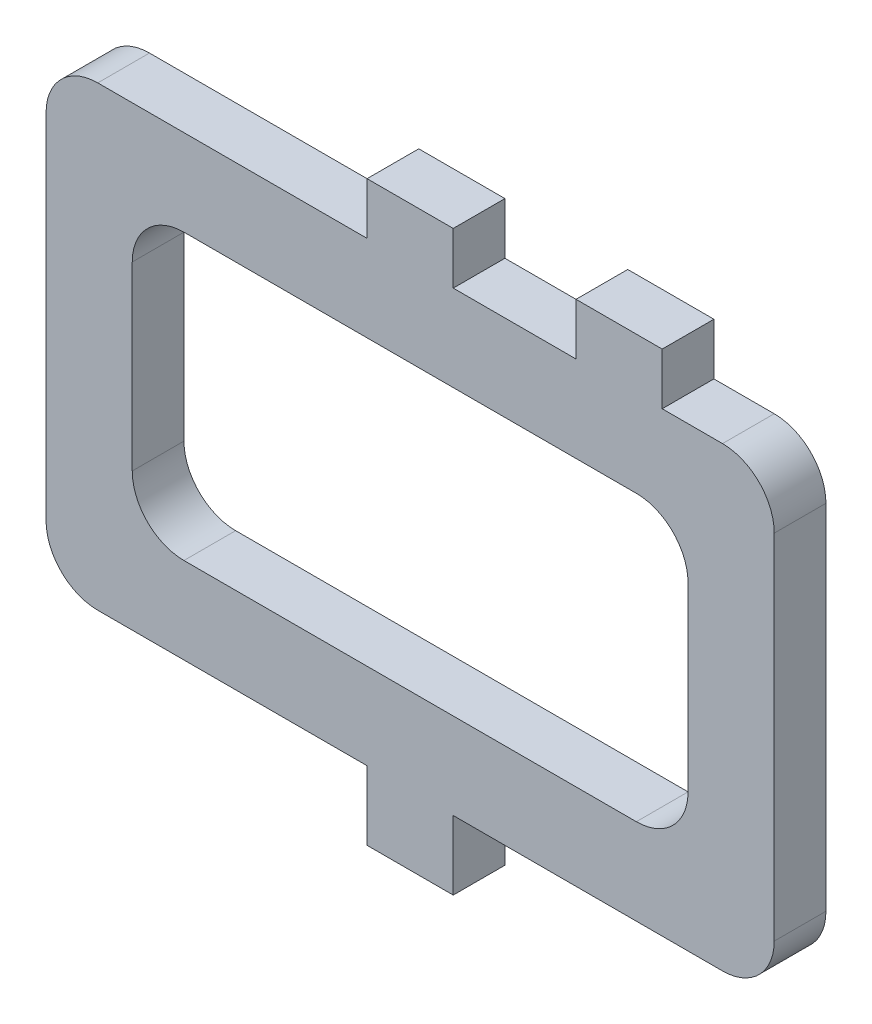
ISO-10303-21;
HEADER;
FILE_DESCRIPTION(('STEP AP214'),'2;1');
FILE_NAME('part.step','',(''),(''),'','','');
FILE_SCHEMA(('AUTOMOTIVE_DESIGN { 1 0 10303 214 1 1 1 1 }'));
ENDSEC;
DATA;
#1=APPLICATION_CONTEXT('core data for automotive mechanical design processes');
#2=APPLICATION_PROTOCOL_DEFINITION('international standard','automotive_design',2000,#1);
#3=PRODUCT_CONTEXT('',#1,'mechanical');
#4=PRODUCT('Part','Part','',(#3));
#5=PRODUCT_RELATED_PRODUCT_CATEGORY('part','',(#4));
#6=PRODUCT_DEFINITION_FORMATION('','',#4);
#7=PRODUCT_DEFINITION_CONTEXT('part definition',#1,'design');
#8=PRODUCT_DEFINITION('design','',#6,#7);
#9=PRODUCT_DEFINITION_SHAPE('','',#8);
#10=(LENGTH_UNIT() NAMED_UNIT(*) SI_UNIT(.MILLI.,.METRE.));
#11=(NAMED_UNIT(*) PLANE_ANGLE_UNIT() SI_UNIT($,.RADIAN.));
#12=(NAMED_UNIT(*) SI_UNIT($,.STERADIAN.) SOLID_ANGLE_UNIT());
#13=UNCERTAINTY_MEASURE_WITH_UNIT(LENGTH_MEASURE(1.E-05),#10,'distance_accuracy_value','');
#14=(GEOMETRIC_REPRESENTATION_CONTEXT(3) GLOBAL_UNCERTAINTY_ASSIGNED_CONTEXT((#13)) GLOBAL_UNIT_ASSIGNED_CONTEXT((#10,
#11,#12)) REPRESENTATION_CONTEXT('',''));
#15=CARTESIAN_POINT('',(0.,0.,0.));
#16=DIRECTION('',(0.,0.,1.));
#17=DIRECTION('',(1.,0.,0.));
#18=AXIS2_PLACEMENT_3D('',#15,#16,#17);
#19=CARTESIAN_POINT('',(-123.240102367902,-87.7219528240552,3.));
#20=DIRECTION('',(0.,0.,-1.));
#21=DIRECTION('',(-1.,0.,0.));
#22=AXIS2_PLACEMENT_3D('',#19,#20,#21);
#23=CYLINDRICAL_SURFACE('',#22,3.);
#24=CARTESIAN_POINT('',(-123.240102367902,-87.7219528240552,0.));
#25=DIRECTION('',(0.,0.,1.));
#26=DIRECTION('',(1.,0.,0.));
#27=AXIS2_PLACEMENT_3D('',#24,#25,#26);
#28=CIRCLE('',#27,3.);
#29=CARTESIAN_POINT('',(-126.240102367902,-87.7219528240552,0.));
#30=VERTEX_POINT('',#29);
#31=CARTESIAN_POINT('',(-123.240102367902,-90.7219528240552,0.));
#32=VERTEX_POINT('',#31);
#33=EDGE_CURVE('E258',#30,#32,#28,.T.);
#34=ORIENTED_EDGE('',*,*,#33,.T.);
#35=DIRECTION('',(0.,0.,-1.));
#36=VECTOR('',#35,1.);
#37=CARTESIAN_POINT('',(-123.240102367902,-90.7219528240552,3.));
#38=LINE('',#37,#36);
#39=CARTESIAN_POINT('',(-123.240102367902,-90.7219528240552,3.));
#40=VERTEX_POINT('',#39);
#41=EDGE_CURVE('E409',#40,#32,#38,.T.);
#42=ORIENTED_EDGE('',*,*,#41,.F.);
#43=CARTESIAN_POINT('',(-123.240102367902,-87.7219528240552,3.));
#44=DIRECTION('',(0.,0.,1.));
#45=DIRECTION('',(1.,0.,0.));
#46=AXIS2_PLACEMENT_3D('',#43,#44,#45);
#47=CIRCLE('',#46,3.);
#48=CARTESIAN_POINT('',(-126.240102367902,-87.7219528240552,3.));
#49=VERTEX_POINT('',#48);
#50=EDGE_CURVE('E269',#49,#40,#47,.T.);
#51=ORIENTED_EDGE('',*,*,#50,.F.);
#52=DIRECTION('',(0.,0.,-1.));
#53=VECTOR('',#52,1.);
#54=CARTESIAN_POINT('',(-126.240102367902,-87.7219528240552,3.));
#55=LINE('',#54,#53);
#56=EDGE_CURVE('E311',#49,#30,#55,.T.);
#57=ORIENTED_EDGE('',*,*,#56,.T.);
#58=EDGE_LOOP('',(#34,#42,#51,#57));
#59=FACE_BOUND('',#58,.T.);
#60=ADVANCED_FACE('F35',(#59),#23,.T.);
#61=CARTESIAN_POINT('',(-107.615102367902,-90.7219528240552,3.));
#62=DIRECTION('',(0.,1.,0.));
#63=DIRECTION('',(0.,0.,1.));
#64=AXIS2_PLACEMENT_3D('',#61,#62,#63);
#65=PLANE('',#64);
#66=DIRECTION('',(1.,0.,0.));
#67=VECTOR('',#66,1.);
#68=CARTESIAN_POINT('',(-107.615102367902,-90.7219528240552,0.));
#69=LINE('',#68,#67);
#70=CARTESIAN_POINT('',(-107.615102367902,-90.7219528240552,0.));
#71=VERTEX_POINT('',#70);
#72=EDGE_CURVE('E314',#32,#71,#69,.T.);
#73=ORIENTED_EDGE('',*,*,#72,.T.);
#74=DIRECTION('',(0.,0.,-1.));
#75=VECTOR('',#74,1.);
#76=CARTESIAN_POINT('',(-107.615102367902,-90.7219528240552,3.));
#77=LINE('',#76,#75);
#78=CARTESIAN_POINT('',(-107.615102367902,-90.7219528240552,3.));
#79=VERTEX_POINT('',#78);
#80=EDGE_CURVE('E406',#79,#71,#77,.T.);
#81=ORIENTED_EDGE('',*,*,#80,.F.);
#82=DIRECTION('',(1.,0.,0.));
#83=VECTOR('',#82,1.);
#84=CARTESIAN_POINT('',(-107.615102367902,-90.7219528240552,3.));
#85=LINE('',#84,#83);
#86=EDGE_CURVE('E272',#40,#79,#85,.T.);
#87=ORIENTED_EDGE('',*,*,#86,.F.);
#88=ORIENTED_EDGE('',*,*,#41,.T.);
#89=EDGE_LOOP('',(#73,#81,#87,#88));
#90=FACE_BOUND('',#89,.T.);
#91=ADVANCED_FACE('F460',(#90),#65,.F.);
#92=CARTESIAN_POINT('',(-107.615102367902,-94.7219528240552,3.));
#93=DIRECTION('',(1.,0.,0.));
#94=DIRECTION('',(0.,0.,-1.));
#95=AXIS2_PLACEMENT_3D('',#92,#93,#94);
#96=PLANE('',#95);
#97=DIRECTION('',(0.,-1.,0.));
#98=VECTOR('',#97,1.);
#99=CARTESIAN_POINT('',(-107.615102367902,-94.7219528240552,0.));
#100=LINE('',#99,#98);
#101=CARTESIAN_POINT('',(-107.615102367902,-94.7219528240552,0.));
#102=VERTEX_POINT('',#101);
#103=EDGE_CURVE('E316',#71,#102,#100,.T.);
#104=ORIENTED_EDGE('',*,*,#103,.T.);
#105=DIRECTION('',(0.,0.,-1.));
#106=VECTOR('',#105,1.);
#107=CARTESIAN_POINT('',(-107.615102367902,-94.7219528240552,3.));
#108=LINE('',#107,#106);
#109=CARTESIAN_POINT('',(-107.615102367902,-94.7219528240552,3.));
#110=VERTEX_POINT('',#109);
#111=EDGE_CURVE('E403',#110,#102,#108,.T.);
#112=ORIENTED_EDGE('',*,*,#111,.F.);
#113=DIRECTION('',(0.,-1.,0.));
#114=VECTOR('',#113,1.);
#115=CARTESIAN_POINT('',(-107.615102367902,-94.7219528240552,3.));
#116=LINE('',#115,#114);
#117=EDGE_CURVE('E275',#79,#110,#116,.T.);
#118=ORIENTED_EDGE('',*,*,#117,.F.);
#119=ORIENTED_EDGE('',*,*,#80,.T.);
#120=EDGE_LOOP('',(#104,#112,#118,#119));
#121=FACE_BOUND('',#120,.T.);
#122=ADVANCED_FACE('F465',(#121),#96,.F.);
#123=CARTESIAN_POINT('',(-105.115102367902,-94.7219528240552,3.));
#124=DIRECTION('',(0.,1.,0.));
#125=DIRECTION('',(0.,0.,1.));
#126=AXIS2_PLACEMENT_3D('',#123,#124,#125);
#127=PLANE('',#126);
#128=DIRECTION('',(1.,0.,0.));
#129=VECTOR('',#128,1.);
#130=CARTESIAN_POINT('',(-105.115102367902,-94.7219528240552,0.));
#131=LINE('',#130,#129);
#132=CARTESIAN_POINT('',(-102.615102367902,-94.7219528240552,0.));
#133=VERTEX_POINT('',#132);
#134=EDGE_CURVE('E319',#102,#133,#131,.T.);
#135=ORIENTED_EDGE('',*,*,#134,.T.);
#136=DIRECTION('',(0.,0.,-1.));
#137=VECTOR('',#136,1.);
#138=CARTESIAN_POINT('',(-102.615102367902,-94.7219528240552,3.));
#139=LINE('',#138,#137);
#140=CARTESIAN_POINT('',(-102.615102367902,-94.7219528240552,3.));
#141=VERTEX_POINT('',#140);
#142=EDGE_CURVE('E400',#141,#133,#139,.T.);
#143=ORIENTED_EDGE('',*,*,#142,.F.);
#144=DIRECTION('',(1.,0.,0.));
#145=VECTOR('',#144,1.);
#146=CARTESIAN_POINT('',(-107.615102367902,-94.7219528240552,3.));
#147=LINE('',#146,#145);
#148=EDGE_CURVE('E277',#110,#141,#147,.T.);
#149=ORIENTED_EDGE('',*,*,#148,.F.);
#150=ORIENTED_EDGE('',*,*,#111,.T.);
#151=EDGE_LOOP('',(#135,#143,#149,#150));
#152=FACE_BOUND('',#151,.T.);
#153=ADVANCED_FACE('F557',(#152),#127,.F.);
#154=CARTESIAN_POINT('',(-102.615102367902,-94.7219528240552,3.));
#155=DIRECTION('',(-1.,0.,0.));
#156=DIRECTION('',(0.,0.,1.));
#157=AXIS2_PLACEMENT_3D('',#154,#155,#156);
#158=PLANE('',#157);
#159=DIRECTION('',(0.,1.,0.));
#160=VECTOR('',#159,1.);
#161=CARTESIAN_POINT('',(-102.615102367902,-94.7219528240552,0.));
#162=LINE('',#161,#160);
#163=CARTESIAN_POINT('',(-102.615102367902,-90.7219528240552,0.));
#164=VERTEX_POINT('',#163);
#165=EDGE_CURVE('E321',#133,#164,#162,.T.);
#166=ORIENTED_EDGE('',*,*,#165,.T.);
#167=DIRECTION('',(0.,0.,-1.));
#168=VECTOR('',#167,1.);
#169=CARTESIAN_POINT('',(-102.615102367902,-90.7219528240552,3.));
#170=LINE('',#169,#168);
#171=CARTESIAN_POINT('',(-102.615102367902,-90.7219528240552,3.));
#172=VERTEX_POINT('',#171);
#173=EDGE_CURVE('E397',#172,#164,#170,.T.);
#174=ORIENTED_EDGE('',*,*,#173,.F.);
#175=DIRECTION('',(0.,1.,0.));
#176=VECTOR('',#175,1.);
#177=CARTESIAN_POINT('',(-102.615102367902,-94.7219528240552,3.));
#178=LINE('',#177,#176);
#179=EDGE_CURVE('E279',#141,#172,#178,.T.);
#180=ORIENTED_EDGE('',*,*,#179,.F.);
#181=ORIENTED_EDGE('',*,*,#142,.T.);
#182=EDGE_LOOP('',(#166,#174,#180,#181));
#183=FACE_BOUND('',#182,.T.);
#184=ADVANCED_FACE('F551',(#183),#158,.F.);
#185=CARTESIAN_POINT('',(-102.615102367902,-90.7219528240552,3.));
#186=DIRECTION('',(0.,1.,0.));
#187=DIRECTION('',(0.,0.,1.));
#188=AXIS2_PLACEMENT_3D('',#185,#186,#187);
#189=PLANE('',#188);
#190=DIRECTION('',(1.,0.,0.));
#191=VECTOR('',#190,1.);
#192=CARTESIAN_POINT('',(-102.615102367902,-90.7219528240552,0.));
#193=LINE('',#192,#191);
#194=CARTESIAN_POINT('',(-86.9901023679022,-90.7219528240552,0.));
#195=VERTEX_POINT('',#194);
#196=EDGE_CURVE('E323',#164,#195,#193,.T.);
#197=ORIENTED_EDGE('',*,*,#196,.T.);
#198=DIRECTION('',(0.,0.,-1.));
#199=VECTOR('',#198,1.);
#200=CARTESIAN_POINT('',(-86.9901023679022,-90.7219528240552,3.));
#201=LINE('',#200,#199);
#202=CARTESIAN_POINT('',(-86.9901023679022,-90.7219528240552,3.));
#203=VERTEX_POINT('',#202);
#204=EDGE_CURVE('E394',#203,#195,#201,.T.);
#205=ORIENTED_EDGE('',*,*,#204,.F.);
#206=DIRECTION('',(1.,0.,0.));
#207=VECTOR('',#206,1.);
#208=CARTESIAN_POINT('',(-102.615102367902,-90.7219528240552,3.));
#209=LINE('',#208,#207);
#210=EDGE_CURVE('E281',#172,#203,#209,.T.);
#211=ORIENTED_EDGE('',*,*,#210,.F.);
#212=ORIENTED_EDGE('',*,*,#173,.T.);
#213=EDGE_LOOP('',(#197,#205,#211,#212));
#214=FACE_BOUND('',#213,.T.);
#215=ADVANCED_FACE('F547',(#214),#189,.F.);
#216=CARTESIAN_POINT('',(-86.9901023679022,-87.7219528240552,3.));
#217=DIRECTION('',(0.,0.,-1.));
#218=DIRECTION('',(-1.,0.,0.));
#219=AXIS2_PLACEMENT_3D('',#216,#217,#218);
#220=CYLINDRICAL_SURFACE('',#219,3.);
#221=CARTESIAN_POINT('',(-86.9901023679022,-87.7219528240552,0.));
#222=DIRECTION('',(0.,0.,1.));
#223=DIRECTION('',(1.,0.,0.));
#224=AXIS2_PLACEMENT_3D('',#221,#222,#223);
#225=CIRCLE('',#224,3.);
#226=CARTESIAN_POINT('',(-83.9901023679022,-87.7219528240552,0.));
#227=VERTEX_POINT('',#226);
#228=EDGE_CURVE('E325',#195,#227,#225,.T.);
#229=ORIENTED_EDGE('',*,*,#228,.T.);
#230=DIRECTION('',(0.,0.,-1.));
#231=VECTOR('',#230,1.);
#232=CARTESIAN_POINT('',(-83.9901023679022,-87.7219528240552,3.));
#233=LINE('',#232,#231);
#234=CARTESIAN_POINT('',(-83.9901023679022,-87.7219528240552,3.));
#235=VERTEX_POINT('',#234);
#236=EDGE_CURVE('E391',#235,#227,#233,.T.);
#237=ORIENTED_EDGE('',*,*,#236,.F.);
#238=CARTESIAN_POINT('',(-86.9901023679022,-87.7219528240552,3.));
#239=DIRECTION('',(0.,0.,1.));
#240=DIRECTION('',(1.,0.,0.));
#241=AXIS2_PLACEMENT_3D('',#238,#239,#240);
#242=CIRCLE('',#241,3.);
#243=EDGE_CURVE('E283',#203,#235,#242,.T.);
#244=ORIENTED_EDGE('',*,*,#243,.F.);
#245=ORIENTED_EDGE('',*,*,#204,.T.);
#246=EDGE_LOOP('',(#229,#237,#244,#245));
#247=FACE_BOUND('',#246,.T.);
#248=ADVANCED_FACE('F542',(#247),#220,.T.);
#249=CARTESIAN_POINT('',(-83.9901023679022,-87.7219528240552,3.));
#250=DIRECTION('',(-1.,0.,0.));
#251=DIRECTION('',(0.,-1.,0.));
#252=AXIS2_PLACEMENT_3D('',#249,#250,#251);
#253=PLANE('',#252);
#254=DIRECTION('',(0.,1.,0.));
#255=VECTOR('',#254,1.);
#256=CARTESIAN_POINT('',(-83.9901023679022,-87.7219528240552,0.));
#257=LINE('',#256,#255);
#258=CARTESIAN_POINT('',(-83.9901023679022,-67.2219528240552,0.));
#259=VERTEX_POINT('',#258);
#260=EDGE_CURVE('E327',#227,#259,#257,.T.);
#261=ORIENTED_EDGE('',*,*,#260,.T.);
#262=DIRECTION('',(0.,0.,-1.));
#263=VECTOR('',#262,1.);
#264=CARTESIAN_POINT('',(-83.9901023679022,-67.2219528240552,3.));
#265=LINE('',#264,#263);
#266=CARTESIAN_POINT('',(-83.9901023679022,-67.2219528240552,3.));
#267=VERTEX_POINT('',#266);
#268=EDGE_CURVE('E388',#267,#259,#265,.T.);
#269=ORIENTED_EDGE('',*,*,#268,.F.);
#270=DIRECTION('',(0.,1.,0.));
#271=VECTOR('',#270,1.);
#272=CARTESIAN_POINT('',(-83.9901023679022,-87.7219528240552,3.));
#273=LINE('',#272,#271);
#274=EDGE_CURVE('E285',#235,#267,#273,.T.);
#275=ORIENTED_EDGE('',*,*,#274,.F.);
#276=ORIENTED_EDGE('',*,*,#236,.T.);
#277=EDGE_LOOP('',(#261,#269,#275,#276));
#278=FACE_BOUND('',#277,.T.);
#279=ADVANCED_FACE('F536',(#278),#253,.F.);
#280=CARTESIAN_POINT('',(-86.9901023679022,-67.2219528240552,3.));
#281=DIRECTION('',(0.,0.,-1.));
#282=DIRECTION('',(-1.,0.,0.));
#283=AXIS2_PLACEMENT_3D('',#280,#281,#282);
#284=CYLINDRICAL_SURFACE('',#283,3.);
#285=CARTESIAN_POINT('',(-86.9901023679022,-67.2219528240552,0.));
#286=DIRECTION('',(0.,0.,1.));
#287=DIRECTION('',(1.,0.,0.));
#288=AXIS2_PLACEMENT_3D('',#285,#286,#287);
#289=CIRCLE('',#288,3.);
#290=CARTESIAN_POINT('',(-86.9901023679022,-64.2219528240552,0.));
#291=VERTEX_POINT('',#290);
#292=EDGE_CURVE('E329',#259,#291,#289,.T.);
#293=ORIENTED_EDGE('',*,*,#292,.T.);
#294=DIRECTION('',(0.,0.,-1.));
#295=VECTOR('',#294,1.);
#296=CARTESIAN_POINT('',(-86.9901023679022,-64.2219528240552,3.));
#297=LINE('',#296,#295);
#298=CARTESIAN_POINT('',(-86.9901023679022,-64.2219528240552,3.));
#299=VERTEX_POINT('',#298);
#300=EDGE_CURVE('E385',#299,#291,#297,.T.);
#301=ORIENTED_EDGE('',*,*,#300,.F.);
#302=CARTESIAN_POINT('',(-86.9901023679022,-67.2219528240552,3.));
#303=DIRECTION('',(0.,0.,1.));
#304=DIRECTION('',(1.,0.,0.));
#305=AXIS2_PLACEMENT_3D('',#302,#303,#304);
#306=CIRCLE('',#305,3.);
#307=EDGE_CURVE('E287',#267,#299,#306,.T.);
#308=ORIENTED_EDGE('',*,*,#307,.F.);
#309=ORIENTED_EDGE('',*,*,#268,.T.);
#310=EDGE_LOOP('',(#293,#301,#308,#309));
#311=FACE_BOUND('',#310,.T.);
#312=ADVANCED_FACE('F532',(#311),#284,.T.);
#313=CARTESIAN_POINT('',(-90.4901023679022,-64.2219528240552,3.));
#314=DIRECTION('',(0.,-1.,0.));
#315=DIRECTION('',(0.,0.,-1.));
#316=AXIS2_PLACEMENT_3D('',#313,#314,#315);
#317=PLANE('',#316);
#318=DIRECTION('',(-1.,0.,0.));
#319=VECTOR('',#318,1.);
#320=CARTESIAN_POINT('',(-90.4901023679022,-64.2219528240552,0.));
#321=LINE('',#320,#319);
#322=CARTESIAN_POINT('',(-90.4901023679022,-64.2219528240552,0.));
#323=VERTEX_POINT('',#322);
#324=EDGE_CURVE('E331',#291,#323,#321,.T.);
#325=ORIENTED_EDGE('',*,*,#324,.T.);
#326=DIRECTION('',(0.,0.,-1.));
#327=VECTOR('',#326,1.);
#328=CARTESIAN_POINT('',(-90.4901023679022,-64.2219528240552,3.));
#329=LINE('',#328,#327);
#330=CARTESIAN_POINT('',(-90.4901023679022,-64.2219528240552,3.));
#331=VERTEX_POINT('',#330);
#332=EDGE_CURVE('E382',#331,#323,#329,.T.);
#333=ORIENTED_EDGE('',*,*,#332,.F.);
#334=DIRECTION('',(-1.,0.,0.));
#335=VECTOR('',#334,1.);
#336=CARTESIAN_POINT('',(-90.4901023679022,-64.2219528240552,3.));
#337=LINE('',#336,#335);
#338=EDGE_CURVE('E289',#299,#331,#337,.T.);
#339=ORIENTED_EDGE('',*,*,#338,.F.);
#340=ORIENTED_EDGE('',*,*,#300,.T.);
#341=EDGE_LOOP('',(#325,#333,#339,#340));
#342=FACE_BOUND('',#341,.T.);
#343=ADVANCED_FACE('F527',(#342),#317,.F.);
#344=CARTESIAN_POINT('',(-90.4901023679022,-61.2219528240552,3.));
#345=DIRECTION('',(-1.,0.,0.));
#346=DIRECTION('',(0.,0.,1.));
#347=AXIS2_PLACEMENT_3D('',#344,#345,#346);
#348=PLANE('',#347);
#349=DIRECTION('',(0.,1.,0.));
#350=VECTOR('',#349,1.);
#351=CARTESIAN_POINT('',(-90.4901023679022,-61.2219528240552,0.));
#352=LINE('',#351,#350);
#353=CARTESIAN_POINT('',(-90.4901023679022,-61.2219528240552,0.));
#354=VERTEX_POINT('',#353);
#355=EDGE_CURVE('E333',#323,#354,#352,.T.);
#356=ORIENTED_EDGE('',*,*,#355,.T.);
#357=DIRECTION('',(0.,0.,-1.));
#358=VECTOR('',#357,1.);
#359=CARTESIAN_POINT('',(-90.4901023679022,-61.2219528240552,3.));
#360=LINE('',#359,#358);
#361=CARTESIAN_POINT('',(-90.4901023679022,-61.2219528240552,3.));
#362=VERTEX_POINT('',#361);
#363=EDGE_CURVE('E379',#362,#354,#360,.T.);
#364=ORIENTED_EDGE('',*,*,#363,.F.);
#365=DIRECTION('',(0.,1.,0.));
#366=VECTOR('',#365,1.);
#367=CARTESIAN_POINT('',(-90.4901023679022,-61.2219528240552,3.));
#368=LINE('',#367,#366);
#369=EDGE_CURVE('E291',#331,#362,#368,.T.);
#370=ORIENTED_EDGE('',*,*,#369,.F.);
#371=ORIENTED_EDGE('',*,*,#332,.T.);
#372=EDGE_LOOP('',(#356,#364,#370,#371));
#373=FACE_BOUND('',#372,.T.);
#374=ADVANCED_FACE('F521',(#373),#348,.F.);
#375=CARTESIAN_POINT('',(-95.4901023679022,-61.2219528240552,3.));
#376=DIRECTION('',(0.,-1.,0.));
#377=DIRECTION('',(0.,0.,-1.));
#378=AXIS2_PLACEMENT_3D('',#375,#376,#377);
#379=PLANE('',#378);
#380=DIRECTION('',(-1.,0.,0.));
#381=VECTOR('',#380,1.);
#382=CARTESIAN_POINT('',(-95.4901023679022,-61.2219528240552,0.));
#383=LINE('',#382,#381);
#384=CARTESIAN_POINT('',(-95.4901023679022,-61.2219528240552,0.));
#385=VERTEX_POINT('',#384);
#386=EDGE_CURVE('E335',#354,#385,#383,.T.);
#387=ORIENTED_EDGE('',*,*,#386,.T.);
#388=DIRECTION('',(0.,0.,-1.));
#389=VECTOR('',#388,1.);
#390=CARTESIAN_POINT('',(-95.4901023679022,-61.2219528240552,3.));
#391=LINE('',#390,#389);
#392=CARTESIAN_POINT('',(-95.4901023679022,-61.2219528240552,3.));
#393=VERTEX_POINT('',#392);
#394=EDGE_CURVE('E376',#393,#385,#391,.T.);
#395=ORIENTED_EDGE('',*,*,#394,.F.);
#396=DIRECTION('',(-1.,0.,0.));
#397=VECTOR('',#396,1.);
#398=CARTESIAN_POINT('',(-95.4901023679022,-61.2219528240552,3.));
#399=LINE('',#398,#397);
#400=EDGE_CURVE('E293',#362,#393,#399,.T.);
#401=ORIENTED_EDGE('',*,*,#400,.F.);
#402=ORIENTED_EDGE('',*,*,#363,.T.);
#403=EDGE_LOOP('',(#387,#395,#401,#402));
#404=FACE_BOUND('',#403,.T.);
#405=ADVANCED_FACE('F517',(#404),#379,.F.);
#406=CARTESIAN_POINT('',(-95.4901023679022,-61.2219528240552,3.));
#407=DIRECTION('',(1.,0.,0.));
#408=DIRECTION('',(0.,0.,-1.));
#409=AXIS2_PLACEMENT_3D('',#406,#407,#408);
#410=PLANE('',#409);
#411=DIRECTION('',(0.,-1.,0.));
#412=VECTOR('',#411,1.);
#413=CARTESIAN_POINT('',(-95.4901023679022,-61.2219528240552,0.));
#414=LINE('',#413,#412);
#415=CARTESIAN_POINT('',(-95.4901023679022,-64.2219528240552,0.));
#416=VERTEX_POINT('',#415);
#417=EDGE_CURVE('E337',#385,#416,#414,.T.);
#418=ORIENTED_EDGE('',*,*,#417,.T.);
#419=DIRECTION('',(0.,0.,-1.));
#420=VECTOR('',#419,1.);
#421=CARTESIAN_POINT('',(-95.4901023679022,-64.2219528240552,3.));
#422=LINE('',#421,#420);
#423=CARTESIAN_POINT('',(-95.4901023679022,-64.2219528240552,3.));
#424=VERTEX_POINT('',#423);
#425=EDGE_CURVE('E373',#424,#416,#422,.T.);
#426=ORIENTED_EDGE('',*,*,#425,.F.);
#427=DIRECTION('',(0.,-1.,0.));
#428=VECTOR('',#427,1.);
#429=CARTESIAN_POINT('',(-95.4901023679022,-61.2219528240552,3.));
#430=LINE('',#429,#428);
#431=EDGE_CURVE('E295',#393,#424,#430,.T.);
#432=ORIENTED_EDGE('',*,*,#431,.F.);
#433=ORIENTED_EDGE('',*,*,#394,.T.);
#434=EDGE_LOOP('',(#418,#426,#432,#433));
#435=FACE_BOUND('',#434,.T.);
#436=ADVANCED_FACE('F512',(#435),#410,.F.);
#437=CARTESIAN_POINT('',(-95.4901023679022,-64.2219528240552,3.));
#438=DIRECTION('',(0.,-1.,0.));
#439=DIRECTION('',(0.,0.,-1.));
#440=AXIS2_PLACEMENT_3D('',#437,#438,#439);
#441=PLANE('',#440);
#442=DIRECTION('',(-1.,0.,0.));
#443=VECTOR('',#442,1.);
#444=CARTESIAN_POINT('',(-95.4901023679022,-64.2219528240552,0.));
#445=LINE('',#444,#443);
#446=CARTESIAN_POINT('',(-102.615102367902,-64.2219528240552,0.));
#447=VERTEX_POINT('',#446);
#448=EDGE_CURVE('E339',#416,#447,#445,.T.);
#449=ORIENTED_EDGE('',*,*,#448,.T.);
#450=DIRECTION('',(0.,0.,-1.));
#451=VECTOR('',#450,1.);
#452=CARTESIAN_POINT('',(-102.615102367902,-64.2219528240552,3.));
#453=LINE('',#452,#451);
#454=CARTESIAN_POINT('',(-102.615102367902,-64.2219528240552,3.));
#455=VERTEX_POINT('',#454);
#456=EDGE_CURVE('E370',#455,#447,#453,.T.);
#457=ORIENTED_EDGE('',*,*,#456,.F.);
#458=DIRECTION('',(-1.,0.,0.));
#459=VECTOR('',#458,1.);
#460=CARTESIAN_POINT('',(-95.4901023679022,-64.2219528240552,3.));
#461=LINE('',#460,#459);
#462=EDGE_CURVE('E297',#424,#455,#461,.T.);
#463=ORIENTED_EDGE('',*,*,#462,.F.);
#464=ORIENTED_EDGE('',*,*,#425,.T.);
#465=EDGE_LOOP('',(#449,#457,#463,#464));
#466=FACE_BOUND('',#465,.T.);
#467=ADVANCED_FACE('F506',(#466),#441,.F.);
#468=CARTESIAN_POINT('',(-102.615102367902,-61.2219528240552,3.));
#469=DIRECTION('',(-1.,0.,0.));
#470=DIRECTION('',(0.,0.,1.));
#471=AXIS2_PLACEMENT_3D('',#468,#469,#470);
#472=PLANE('',#471);
#473=DIRECTION('',(0.,1.,0.));
#474=VECTOR('',#473,1.);
#475=CARTESIAN_POINT('',(-102.615102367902,-61.2219528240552,0.));
#476=LINE('',#475,#474);
#477=CARTESIAN_POINT('',(-102.615102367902,-61.2219528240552,0.));
#478=VERTEX_POINT('',#477);
#479=EDGE_CURVE('E341',#447,#478,#476,.T.);
#480=ORIENTED_EDGE('',*,*,#479,.T.);
#481=DIRECTION('',(0.,0.,-1.));
#482=VECTOR('',#481,1.);
#483=CARTESIAN_POINT('',(-102.615102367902,-61.2219528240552,3.));
#484=LINE('',#483,#482);
#485=CARTESIAN_POINT('',(-102.615102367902,-61.2219528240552,3.));
#486=VERTEX_POINT('',#485);
#487=EDGE_CURVE('E367',#486,#478,#484,.T.);
#488=ORIENTED_EDGE('',*,*,#487,.F.);
#489=DIRECTION('',(0.,1.,0.));
#490=VECTOR('',#489,1.);
#491=CARTESIAN_POINT('',(-102.615102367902,-61.2219528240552,3.));
#492=LINE('',#491,#490);
#493=EDGE_CURVE('E299',#455,#486,#492,.T.);
#494=ORIENTED_EDGE('',*,*,#493,.F.);
#495=ORIENTED_EDGE('',*,*,#456,.T.);
#496=EDGE_LOOP('',(#480,#488,#494,#495));
#497=FACE_BOUND('',#496,.T.);
#498=ADVANCED_FACE('F501',(#497),#472,.F.);
#499=CARTESIAN_POINT('',(-107.615102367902,-61.2219528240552,3.));
#500=DIRECTION('',(0.,-1.,0.));
#501=DIRECTION('',(0.,0.,-1.));
#502=AXIS2_PLACEMENT_3D('',#499,#500,#501);
#503=PLANE('',#502);
#504=DIRECTION('',(-1.,0.,0.));
#505=VECTOR('',#504,1.);
#506=CARTESIAN_POINT('',(-107.615102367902,-61.2219528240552,0.));
#507=LINE('',#506,#505);
#508=CARTESIAN_POINT('',(-107.615102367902,-61.2219528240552,0.));
#509=VERTEX_POINT('',#508);
#510=EDGE_CURVE('E344',#478,#509,#507,.T.);
#511=ORIENTED_EDGE('',*,*,#510,.T.);
#512=DIRECTION('',(0.,0.,-1.));
#513=VECTOR('',#512,1.);
#514=CARTESIAN_POINT('',(-107.615102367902,-61.2219528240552,3.));
#515=LINE('',#514,#513);
#516=CARTESIAN_POINT('',(-107.615102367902,-61.2219528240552,3.));
#517=VERTEX_POINT('',#516);
#518=EDGE_CURVE('E364',#517,#509,#515,.T.);
#519=ORIENTED_EDGE('',*,*,#518,.F.);
#520=DIRECTION('',(-1.,0.,0.));
#521=VECTOR('',#520,1.);
#522=CARTESIAN_POINT('',(-105.115102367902,-61.2219528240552,3.));
#523=LINE('',#522,#521);
#524=EDGE_CURVE('E301',#486,#517,#523,.T.);
#525=ORIENTED_EDGE('',*,*,#524,.F.);
#526=ORIENTED_EDGE('',*,*,#487,.T.);
#527=EDGE_LOOP('',(#511,#519,#525,#526));
#528=FACE_BOUND('',#527,.T.);
#529=ADVANCED_FACE('F496',(#528),#503,.F.);
#530=CARTESIAN_POINT('',(-107.615102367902,-61.2219528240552,3.));
#531=DIRECTION('',(1.,0.,0.));
#532=DIRECTION('',(0.,0.,-1.));
#533=AXIS2_PLACEMENT_3D('',#530,#531,#532);
#534=PLANE('',#533);
#535=DIRECTION('',(0.,-1.,0.));
#536=VECTOR('',#535,1.);
#537=CARTESIAN_POINT('',(-107.615102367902,-61.2219528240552,0.));
#538=LINE('',#537,#536);
#539=CARTESIAN_POINT('',(-107.615102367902,-64.2219528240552,0.));
#540=VERTEX_POINT('',#539);
#541=EDGE_CURVE('E346',#509,#540,#538,.T.);
#542=ORIENTED_EDGE('',*,*,#541,.T.);
#543=DIRECTION('',(0.,0.,-1.));
#544=VECTOR('',#543,1.);
#545=CARTESIAN_POINT('',(-107.615102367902,-64.2219528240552,3.));
#546=LINE('',#545,#544);
#547=CARTESIAN_POINT('',(-107.615102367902,-64.2219528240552,3.));
#548=VERTEX_POINT('',#547);
#549=EDGE_CURVE('E361',#548,#540,#546,.T.);
#550=ORIENTED_EDGE('',*,*,#549,.F.);
#551=DIRECTION('',(0.,-1.,0.));
#552=VECTOR('',#551,1.);
#553=CARTESIAN_POINT('',(-107.615102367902,-61.2219528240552,3.));
#554=LINE('',#553,#552);
#555=EDGE_CURVE('E303',#517,#548,#554,.T.);
#556=ORIENTED_EDGE('',*,*,#555,.F.);
#557=ORIENTED_EDGE('',*,*,#518,.T.);
#558=EDGE_LOOP('',(#542,#550,#556,#557));
#559=FACE_BOUND('',#558,.T.);
#560=ADVANCED_FACE('F492',(#559),#534,.F.);
#561=CARTESIAN_POINT('',(-123.240102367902,-64.2219528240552,3.));
#562=DIRECTION('',(0.,-1.,0.));
#563=DIRECTION('',(0.,0.,-1.));
#564=AXIS2_PLACEMENT_3D('',#561,#562,#563);
#565=PLANE('',#564);
#566=DIRECTION('',(-1.,0.,0.));
#567=VECTOR('',#566,1.);
#568=CARTESIAN_POINT('',(-123.240102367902,-64.2219528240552,0.));
#569=LINE('',#568,#567);
#570=CARTESIAN_POINT('',(-123.240102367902,-64.2219528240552,0.));
#571=VERTEX_POINT('',#570);
#572=EDGE_CURVE('E348',#540,#571,#569,.T.);
#573=ORIENTED_EDGE('',*,*,#572,.T.);
#574=DIRECTION('',(0.,0.,-1.));
#575=VECTOR('',#574,1.);
#576=CARTESIAN_POINT('',(-123.240102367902,-64.2219528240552,3.));
#577=LINE('',#576,#575);
#578=CARTESIAN_POINT('',(-123.240102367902,-64.2219528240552,3.));
#579=VERTEX_POINT('',#578);
#580=EDGE_CURVE('E358',#579,#571,#577,.T.);
#581=ORIENTED_EDGE('',*,*,#580,.F.);
#582=DIRECTION('',(-1.,0.,0.));
#583=VECTOR('',#582,1.);
#584=CARTESIAN_POINT('',(-123.240102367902,-64.2219528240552,3.));
#585=LINE('',#584,#583);
#586=EDGE_CURVE('E305',#548,#579,#585,.T.);
#587=ORIENTED_EDGE('',*,*,#586,.F.);
#588=ORIENTED_EDGE('',*,*,#549,.T.);
#589=EDGE_LOOP('',(#573,#581,#587,#588));
#590=FACE_BOUND('',#589,.T.);
#591=ADVANCED_FACE('F487',(#590),#565,.F.);
#592=CARTESIAN_POINT('',(-123.240102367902,-67.2219528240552,3.));
#593=DIRECTION('',(0.,0.,-1.));
#594=DIRECTION('',(-1.,0.,0.));
#595=AXIS2_PLACEMENT_3D('',#592,#593,#594);
#596=CYLINDRICAL_SURFACE('',#595,3.);
#597=CARTESIAN_POINT('',(-123.240102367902,-67.2219528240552,0.));
#598=DIRECTION('',(0.,0.,1.));
#599=DIRECTION('',(-1.,0.,0.));
#600=AXIS2_PLACEMENT_3D('',#597,#598,#599);
#601=CIRCLE('',#600,3.);
#602=CARTESIAN_POINT('',(-126.240102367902,-67.2219528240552,0.));
#603=VERTEX_POINT('',#602);
#604=EDGE_CURVE('E350',#571,#603,#601,.T.);
#605=ORIENTED_EDGE('',*,*,#604,.T.);
#606=DIRECTION('',(0.,0.,-1.));
#607=VECTOR('',#606,1.);
#608=CARTESIAN_POINT('',(-126.240102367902,-67.2219528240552,3.));
#609=LINE('',#608,#607);
#610=CARTESIAN_POINT('',(-126.240102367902,-67.2219528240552,3.));
#611=VERTEX_POINT('',#610);
#612=EDGE_CURVE('E355',#611,#603,#609,.T.);
#613=ORIENTED_EDGE('',*,*,#612,.F.);
#614=CARTESIAN_POINT('',(-123.240102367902,-67.2219528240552,3.));
#615=DIRECTION('',(0.,0.,1.));
#616=DIRECTION('',(-1.,0.,0.));
#617=AXIS2_PLACEMENT_3D('',#614,#615,#616);
#618=CIRCLE('',#617,3.);
#619=EDGE_CURVE('E307',#579,#611,#618,.T.);
#620=ORIENTED_EDGE('',*,*,#619,.F.);
#621=ORIENTED_EDGE('',*,*,#580,.T.);
#622=EDGE_LOOP('',(#605,#613,#620,#621));
#623=FACE_BOUND('',#622,.T.);
#624=ADVANCED_FACE('F482',(#623),#596,.T.);
#625=CARTESIAN_POINT('',(-126.240102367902,-87.7219528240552,3.));
#626=DIRECTION('',(1.,0.,0.));
#627=DIRECTION('',(0.,0.,-1.));
#628=AXIS2_PLACEMENT_3D('',#625,#626,#627);
#629=PLANE('',#628);
#630=DIRECTION('',(0.,-1.,0.));
#631=VECTOR('',#630,1.);
#632=CARTESIAN_POINT('',(-126.240102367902,-87.7219528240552,0.));
#633=LINE('',#632,#631);
#634=EDGE_CURVE('E273',#603,#30,#633,.T.);
#635=ORIENTED_EDGE('',*,*,#634,.T.);
#636=ORIENTED_EDGE('',*,*,#56,.F.);
#637=DIRECTION('',(0.,-1.,0.));
#638=VECTOR('',#637,1.);
#639=CARTESIAN_POINT('',(-126.240102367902,-87.7219528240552,3.));
#640=LINE('',#639,#638);
#641=EDGE_CURVE('E309',#611,#49,#640,.T.);
#642=ORIENTED_EDGE('',*,*,#641,.F.);
#643=ORIENTED_EDGE('',*,*,#612,.T.);
#644=EDGE_LOOP('',(#635,#636,#642,#643));
#645=FACE_BOUND('',#644,.T.);
#646=ADVANCED_FACE('F480',(#645),#629,.F.);
#647=CARTESIAN_POINT('',(-123.240102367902,-87.7219528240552,3.));
#648=DIRECTION('',(0.,0.,1.));
#649=DIRECTION('',(1.,0.,0.));
#650=AXIS2_PLACEMENT_3D('',#647,#648,#649);
#651=PLANE('',#650);
#652=CARTESIAN_POINT('',(-118.240102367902,-82.7219528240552,3.));
#653=DIRECTION('',(0.,0.,1.));
#654=DIRECTION('',(-1.,0.,0.));
#655=AXIS2_PLACEMENT_3D('',#652,#653,#654);
#656=CIRCLE('',#655,3.);
#657=CARTESIAN_POINT('',(-121.240102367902,-82.7219528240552,3.));
#658=VERTEX_POINT('',#657);
#659=CARTESIAN_POINT('',(-118.240102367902,-85.7219528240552,3.));
#660=VERTEX_POINT('',#659);
#661=EDGE_CURVE('E49',#658,#660,#656,.T.);
#662=ORIENTED_EDGE('',*,*,#661,.F.);
#663=DIRECTION('',(0.,-1.,0.));
#664=VECTOR('',#663,1.);
#665=CARTESIAN_POINT('',(-121.240102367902,-82.7219528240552,3.));
#666=LINE('',#665,#664);
#667=CARTESIAN_POINT('',(-121.240102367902,-72.2219528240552,3.));
#668=VERTEX_POINT('',#667);
#669=EDGE_CURVE('E253',#668,#658,#666,.T.);
#670=ORIENTED_EDGE('',*,*,#669,.F.);
#671=CARTESIAN_POINT('',(-118.240102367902,-72.2219528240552,3.));
#672=DIRECTION('',(0.,0.,1.));
#673=DIRECTION('',(-1.,0.,0.));
#674=AXIS2_PLACEMENT_3D('',#671,#672,#673);
#675=CIRCLE('',#674,3.);
#676=CARTESIAN_POINT('',(-118.240102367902,-69.2219528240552,3.));
#677=VERTEX_POINT('',#676);
#678=EDGE_CURVE('E250',#677,#668,#675,.T.);
#679=ORIENTED_EDGE('',*,*,#678,.F.);
#680=DIRECTION('',(-1.,0.,0.));
#681=VECTOR('',#680,1.);
#682=CARTESIAN_POINT('',(-118.240102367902,-69.2219528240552,3.));
#683=LINE('',#682,#681);
#684=CARTESIAN_POINT('',(-91.9901023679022,-69.2219528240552,3.));
#685=VERTEX_POINT('',#684);
#686=EDGE_CURVE('E247',#685,#677,#683,.T.);
#687=ORIENTED_EDGE('',*,*,#686,.F.);
#688=CARTESIAN_POINT('',(-91.9901023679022,-72.2219528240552,3.));
#689=DIRECTION('',(0.,0.,1.));
#690=DIRECTION('',(-1.,0.,0.));
#691=AXIS2_PLACEMENT_3D('',#688,#689,#690);
#692=CIRCLE('',#691,3.);
#693=CARTESIAN_POINT('',(-88.9901023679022,-72.2219528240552,3.));
#694=VERTEX_POINT('',#693);
#695=EDGE_CURVE('E241',#694,#685,#692,.T.);
#696=ORIENTED_EDGE('',*,*,#695,.F.);
#697=DIRECTION('',(0.,1.,0.));
#698=VECTOR('',#697,1.);
#699=CARTESIAN_POINT('',(-88.9901023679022,-72.2219528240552,3.));
#700=LINE('',#699,#698);
#701=CARTESIAN_POINT('',(-88.9901023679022,-82.7219528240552,3.));
#702=VERTEX_POINT('',#701);
#703=EDGE_CURVE('E239',#702,#694,#700,.T.);
#704=ORIENTED_EDGE('',*,*,#703,.F.);
#705=CARTESIAN_POINT('',(-91.9901023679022,-82.7219528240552,3.));
#706=DIRECTION('',(0.,0.,1.));
#707=DIRECTION('',(-1.,0.,0.));
#708=AXIS2_PLACEMENT_3D('',#705,#706,#707);
#709=CIRCLE('',#708,3.);
#710=CARTESIAN_POINT('',(-91.9901023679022,-85.7219528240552,3.));
#711=VERTEX_POINT('',#710);
#712=EDGE_CURVE('E222',#711,#702,#709,.T.);
#713=ORIENTED_EDGE('',*,*,#712,.F.);
#714=DIRECTION('',(1.,0.,0.));
#715=VECTOR('',#714,1.);
#716=CARTESIAN_POINT('',(-91.9901023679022,-85.7219528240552,3.));
#717=LINE('',#716,#715);
#718=EDGE_CURVE('E231',#660,#711,#717,.T.);
#719=ORIENTED_EDGE('',*,*,#718,.F.);
#720=EDGE_LOOP('',(#662,#670,#679,#687,#696,#704,#713,#719));
#721=FACE_BOUND('',#720,.T.);
#722=ORIENTED_EDGE('',*,*,#50,.T.);
#723=ORIENTED_EDGE('',*,*,#86,.T.);
#724=ORIENTED_EDGE('',*,*,#117,.T.);
#725=ORIENTED_EDGE('',*,*,#148,.T.);
#726=ORIENTED_EDGE('',*,*,#179,.T.);
#727=ORIENTED_EDGE('',*,*,#210,.T.);
#728=ORIENTED_EDGE('',*,*,#243,.T.);
#729=ORIENTED_EDGE('',*,*,#274,.T.);
#730=ORIENTED_EDGE('',*,*,#307,.T.);
#731=ORIENTED_EDGE('',*,*,#338,.T.);
#732=ORIENTED_EDGE('',*,*,#369,.T.);
#733=ORIENTED_EDGE('',*,*,#400,.T.);
#734=ORIENTED_EDGE('',*,*,#431,.T.);
#735=ORIENTED_EDGE('',*,*,#462,.T.);
#736=ORIENTED_EDGE('',*,*,#493,.T.);
#737=ORIENTED_EDGE('',*,*,#524,.T.);
#738=ORIENTED_EDGE('',*,*,#555,.T.);
#739=ORIENTED_EDGE('',*,*,#586,.T.);
#740=ORIENTED_EDGE('',*,*,#619,.T.);
#741=ORIENTED_EDGE('',*,*,#641,.T.);
#742=EDGE_LOOP('',(#722,#723,#724,#725,#726,#727,#728,#729,#730,#731,#732,#733,#734,#735,#736,
#737,#738,#739,#740,#741));
#743=FACE_BOUND('',#742,.T.);
#744=ADVANCED_FACE('F235',(#721,#743),#651,.T.);
#745=CARTESIAN_POINT('',(-123.240102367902,-87.7219528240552,0.));
#746=DIRECTION('',(0.,0.,1.));
#747=DIRECTION('',(1.,0.,0.));
#748=AXIS2_PLACEMENT_3D('',#745,#746,#747);
#749=PLANE('',#748);
#750=DIRECTION('',(0.,-1.,0.));
#751=VECTOR('',#750,1.);
#752=CARTESIAN_POINT('',(-121.240102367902,-87.7219528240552,0.));
#753=LINE('',#752,#751);
#754=CARTESIAN_POINT('',(-121.240102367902,-72.2219528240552,0.));
#755=VERTEX_POINT('',#754);
#756=CARTESIAN_POINT('',(-121.240102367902,-82.7219528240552,0.));
#757=VERTEX_POINT('',#756);
#758=EDGE_CURVE('E42',#755,#757,#753,.T.);
#759=ORIENTED_EDGE('',*,*,#758,.T.);
#760=CARTESIAN_POINT('',(-118.240102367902,-82.7219528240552,0.));
#761=DIRECTION('',(0.,0.,1.));
#762=DIRECTION('',(1.,0.,0.));
#763=AXIS2_PLACEMENT_3D('',#760,#761,#762);
#764=CIRCLE('',#763,3.);
#765=CARTESIAN_POINT('',(-118.240102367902,-85.7219528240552,0.));
#766=VERTEX_POINT('',#765);
#767=EDGE_CURVE('E11',#757,#766,#764,.T.);
#768=ORIENTED_EDGE('',*,*,#767,.T.);
#769=DIRECTION('',(1.,0.,0.));
#770=VECTOR('',#769,1.);
#771=CARTESIAN_POINT('',(-123.240102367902,-85.7219528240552,0.));
#772=LINE('',#771,#770);
#773=CARTESIAN_POINT('',(-91.9901023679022,-85.7219528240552,0.));
#774=VERTEX_POINT('',#773);
#775=EDGE_CURVE('E412',#766,#774,#772,.T.);
#776=ORIENTED_EDGE('',*,*,#775,.T.);
#777=CARTESIAN_POINT('',(-91.9901023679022,-82.7219528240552,0.));
#778=DIRECTION('',(0.,0.,1.));
#779=DIRECTION('',(1.,0.,0.));
#780=AXIS2_PLACEMENT_3D('',#777,#778,#779);
#781=CIRCLE('',#780,3.);
#782=CARTESIAN_POINT('',(-88.9901023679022,-82.7219528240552,0.));
#783=VERTEX_POINT('',#782);
#784=EDGE_CURVE('E225',#774,#783,#781,.T.);
#785=ORIENTED_EDGE('',*,*,#784,.T.);
#786=DIRECTION('',(0.,1.,0.));
#787=VECTOR('',#786,1.);
#788=CARTESIAN_POINT('',(-88.9901023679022,-87.7219528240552,0.));
#789=LINE('',#788,#787);
#790=CARTESIAN_POINT('',(-88.9901023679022,-72.2219528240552,0.));
#791=VERTEX_POINT('',#790);
#792=EDGE_CURVE('E415',#783,#791,#789,.T.);
#793=ORIENTED_EDGE('',*,*,#792,.T.);
#794=CARTESIAN_POINT('',(-91.9901023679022,-72.2219528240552,0.));
#795=DIRECTION('',(0.,0.,1.));
#796=DIRECTION('',(1.,0.,0.));
#797=AXIS2_PLACEMENT_3D('',#794,#795,#796);
#798=CIRCLE('',#797,3.);
#799=CARTESIAN_POINT('',(-91.9901023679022,-69.2219528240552,0.));
#800=VERTEX_POINT('',#799);
#801=EDGE_CURVE('E418',#791,#800,#798,.T.);
#802=ORIENTED_EDGE('',*,*,#801,.T.);
#803=DIRECTION('',(-1.,0.,0.));
#804=VECTOR('',#803,1.);
#805=CARTESIAN_POINT('',(-123.240102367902,-69.2219528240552,0.));
#806=LINE('',#805,#804);
#807=CARTESIAN_POINT('',(-118.240102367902,-69.2219528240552,0.));
#808=VERTEX_POINT('',#807);
#809=EDGE_CURVE('E421',#800,#808,#806,.T.);
#810=ORIENTED_EDGE('',*,*,#809,.T.);
#811=CARTESIAN_POINT('',(-118.240102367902,-72.2219528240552,0.));
#812=DIRECTION('',(0.,0.,1.));
#813=DIRECTION('',(1.,0.,0.));
#814=AXIS2_PLACEMENT_3D('',#811,#812,#813);
#815=CIRCLE('',#814,3.);
#816=EDGE_CURVE('E424',#808,#755,#815,.T.);
#817=ORIENTED_EDGE('',*,*,#816,.T.);
#818=EDGE_LOOP('',(#759,#768,#776,#785,#793,#802,#810,#817));
#819=FACE_BOUND('',#818,.T.);
#820=ORIENTED_EDGE('',*,*,#33,.F.);
#821=ORIENTED_EDGE('',*,*,#634,.F.);
#822=ORIENTED_EDGE('',*,*,#604,.F.);
#823=ORIENTED_EDGE('',*,*,#572,.F.);
#824=ORIENTED_EDGE('',*,*,#541,.F.);
#825=ORIENTED_EDGE('',*,*,#510,.F.);
#826=ORIENTED_EDGE('',*,*,#479,.F.);
#827=ORIENTED_EDGE('',*,*,#448,.F.);
#828=ORIENTED_EDGE('',*,*,#417,.F.);
#829=ORIENTED_EDGE('',*,*,#386,.F.);
#830=ORIENTED_EDGE('',*,*,#355,.F.);
#831=ORIENTED_EDGE('',*,*,#324,.F.);
#832=ORIENTED_EDGE('',*,*,#292,.F.);
#833=ORIENTED_EDGE('',*,*,#260,.F.);
#834=ORIENTED_EDGE('',*,*,#228,.F.);
#835=ORIENTED_EDGE('',*,*,#196,.F.);
#836=ORIENTED_EDGE('',*,*,#165,.F.);
#837=ORIENTED_EDGE('',*,*,#134,.F.);
#838=ORIENTED_EDGE('',*,*,#103,.F.);
#839=ORIENTED_EDGE('',*,*,#72,.F.);
#840=EDGE_LOOP('',(#820,#821,#822,#823,#824,#825,#826,#827,#828,#829,#830,#831,#832,#833,#834,
#835,#836,#837,#838,#839));
#841=FACE_BOUND('',#840,.T.);
#842=ADVANCED_FACE('F428',(#819,#841),#749,.F.);
#843=CARTESIAN_POINT('',(-118.240102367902,-82.7219528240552,-1.));
#844=DIRECTION('',(0.,0.,1.));
#845=DIRECTION('',(1.,0.,0.));
#846=AXIS2_PLACEMENT_3D('',#843,#844,#845);
#847=CYLINDRICAL_SURFACE('',#846,3.);
#848=DIRECTION('',(0.,0.,1.));
#849=VECTOR('',#848,1.);
#850=CARTESIAN_POINT('',(-121.240102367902,-82.7219528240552,-1.));
#851=LINE('',#850,#849);
#852=EDGE_CURVE('E256',#757,#658,#851,.T.);
#853=ORIENTED_EDGE('',*,*,#852,.T.);
#854=ORIENTED_EDGE('',*,*,#661,.T.);
#855=DIRECTION('',(0.,0.,1.));
#856=VECTOR('',#855,1.);
#857=CARTESIAN_POINT('',(-118.240102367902,-85.7219528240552,-1.));
#858=LINE('',#857,#856);
#859=EDGE_CURVE('E228',#766,#660,#858,.T.);
#860=ORIENTED_EDGE('',*,*,#859,.F.);
#861=ORIENTED_EDGE('',*,*,#767,.F.);
#862=EDGE_LOOP('',(#853,#854,#860,#861));
#863=FACE_BOUND('',#862,.T.);
#864=ADVANCED_FACE('F448',(#863),#847,.F.);
#865=CARTESIAN_POINT('',(-121.240102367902,-82.7219528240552,-1.));
#866=DIRECTION('',(-1.,0.,0.));
#867=DIRECTION('',(0.,0.,1.));
#868=AXIS2_PLACEMENT_3D('',#865,#866,#867);
#869=PLANE('',#868);
#870=DIRECTION('',(0.,0.,1.));
#871=VECTOR('',#870,1.);
#872=CARTESIAN_POINT('',(-121.240102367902,-72.2219528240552,-1.));
#873=LINE('',#872,#871);
#874=EDGE_CURVE('E259',#755,#668,#873,.T.);
#875=ORIENTED_EDGE('',*,*,#874,.T.);
#876=ORIENTED_EDGE('',*,*,#669,.T.);
#877=ORIENTED_EDGE('',*,*,#852,.F.);
#878=ORIENTED_EDGE('',*,*,#758,.F.);
#879=EDGE_LOOP('',(#875,#876,#877,#878));
#880=FACE_BOUND('',#879,.T.);
#881=ADVANCED_FACE('F433',(#880),#869,.F.);
#882=CARTESIAN_POINT('',(-118.240102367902,-72.2219528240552,-1.));
#883=DIRECTION('',(0.,0.,1.));
#884=DIRECTION('',(1.,0.,0.));
#885=AXIS2_PLACEMENT_3D('',#882,#883,#884);
#886=CYLINDRICAL_SURFACE('',#885,3.);
#887=DIRECTION('',(0.,0.,1.));
#888=VECTOR('',#887,1.);
#889=CARTESIAN_POINT('',(-118.240102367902,-69.2219528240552,-1.));
#890=LINE('',#889,#888);
#891=EDGE_CURVE('E261',#808,#677,#890,.T.);
#892=ORIENTED_EDGE('',*,*,#891,.T.);
#893=ORIENTED_EDGE('',*,*,#678,.T.);
#894=ORIENTED_EDGE('',*,*,#874,.F.);
#895=ORIENTED_EDGE('',*,*,#816,.F.);
#896=EDGE_LOOP('',(#892,#893,#894,#895));
#897=FACE_BOUND('',#896,.T.);
#898=ADVANCED_FACE('F435',(#897),#886,.F.);
#899=CARTESIAN_POINT('',(-118.240102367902,-69.2219528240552,-1.));
#900=DIRECTION('',(0.,1.,0.));
#901=DIRECTION('',(0.,0.,1.));
#902=AXIS2_PLACEMENT_3D('',#899,#900,#901);
#903=PLANE('',#902);
#904=DIRECTION('',(0.,0.,1.));
#905=VECTOR('',#904,1.);
#906=CARTESIAN_POINT('',(-91.9901023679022,-69.2219528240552,-1.));
#907=LINE('',#906,#905);
#908=EDGE_CURVE('E263',#800,#685,#907,.T.);
#909=ORIENTED_EDGE('',*,*,#908,.T.);
#910=ORIENTED_EDGE('',*,*,#686,.T.);
#911=ORIENTED_EDGE('',*,*,#891,.F.);
#912=ORIENTED_EDGE('',*,*,#809,.F.);
#913=EDGE_LOOP('',(#909,#910,#911,#912));
#914=FACE_BOUND('',#913,.T.);
#915=ADVANCED_FACE('F441',(#914),#903,.F.);
#916=CARTESIAN_POINT('',(-91.9901023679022,-72.2219528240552,-1.));
#917=DIRECTION('',(0.,0.,1.));
#918=DIRECTION('',(1.,0.,0.));
#919=AXIS2_PLACEMENT_3D('',#916,#917,#918);
#920=CYLINDRICAL_SURFACE('',#919,3.);
#921=DIRECTION('',(0.,0.,1.));
#922=VECTOR('',#921,1.);
#923=CARTESIAN_POINT('',(-88.9901023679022,-72.2219528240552,-1.));
#924=LINE('',#923,#922);
#925=EDGE_CURVE('E265',#791,#694,#924,.T.);
#926=ORIENTED_EDGE('',*,*,#925,.T.);
#927=ORIENTED_EDGE('',*,*,#695,.T.);
#928=ORIENTED_EDGE('',*,*,#908,.F.);
#929=ORIENTED_EDGE('',*,*,#801,.F.);
#930=EDGE_LOOP('',(#926,#927,#928,#929));
#931=FACE_BOUND('',#930,.T.);
#932=ADVANCED_FACE('F444',(#931),#920,.F.);
#933=CARTESIAN_POINT('',(-88.9901023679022,-72.2219528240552,-1.));
#934=DIRECTION('',(1.,0.,0.));
#935=DIRECTION('',(0.,0.,-1.));
#936=AXIS2_PLACEMENT_3D('',#933,#934,#935);
#937=PLANE('',#936);
#938=DIRECTION('',(0.,0.,1.));
#939=VECTOR('',#938,1.);
#940=CARTESIAN_POINT('',(-88.9901023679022,-82.7219528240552,-1.));
#941=LINE('',#940,#939);
#942=EDGE_CURVE('E227',#783,#702,#941,.T.);
#943=ORIENTED_EDGE('',*,*,#942,.T.);
#944=ORIENTED_EDGE('',*,*,#703,.T.);
#945=ORIENTED_EDGE('',*,*,#925,.F.);
#946=ORIENTED_EDGE('',*,*,#792,.F.);
#947=EDGE_LOOP('',(#943,#944,#945,#946));
#948=FACE_BOUND('',#947,.T.);
#949=ADVANCED_FACE('F447',(#948),#937,.F.);
#950=CARTESIAN_POINT('',(-91.9901023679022,-82.7219528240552,-1.));
#951=DIRECTION('',(0.,0.,1.));
#952=DIRECTION('',(1.,0.,0.));
#953=AXIS2_PLACEMENT_3D('',#950,#951,#952);
#954=CYLINDRICAL_SURFACE('',#953,3.);
#955=DIRECTION('',(0.,0.,1.));
#956=VECTOR('',#955,1.);
#957=CARTESIAN_POINT('',(-91.9901023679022,-85.7219528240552,-1.));
#958=LINE('',#957,#956);
#959=EDGE_CURVE('E57',#774,#711,#958,.T.);
#960=ORIENTED_EDGE('',*,*,#959,.T.);
#961=ORIENTED_EDGE('',*,*,#712,.T.);
#962=ORIENTED_EDGE('',*,*,#942,.F.);
#963=ORIENTED_EDGE('',*,*,#784,.F.);
#964=EDGE_LOOP('',(#960,#961,#962,#963));
#965=FACE_BOUND('',#964,.T.);
#966=ADVANCED_FACE('F219',(#965),#954,.F.);
#967=CARTESIAN_POINT('',(-91.9901023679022,-85.7219528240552,-1.));
#968=DIRECTION('',(0.,-1.,0.));
#969=DIRECTION('',(0.,0.,-1.));
#970=AXIS2_PLACEMENT_3D('',#967,#968,#969);
#971=PLANE('',#970);
#972=ORIENTED_EDGE('',*,*,#859,.T.);
#973=ORIENTED_EDGE('',*,*,#718,.T.);
#974=ORIENTED_EDGE('',*,*,#959,.F.);
#975=ORIENTED_EDGE('',*,*,#775,.F.);
#976=EDGE_LOOP('',(#972,#973,#974,#975));
#977=FACE_BOUND('',#976,.T.);
#978=ADVANCED_FACE('F232',(#977),#971,.F.);
#979=CLOSED_SHELL('',(#60,#91,#122,#153,#184,#215,#248,#279,#312,#343,#374,#405,#436,#467,#498,
#529,#560,#591,#624,#646,#744,#842,#864,#881,#898,#915,#932,#949,#966,#978));
#980=MANIFOLD_SOLID_BREP('B2',#979);
#981=ADVANCED_BREP_SHAPE_REPRESENTATION('',(#18,#980),#14);
#982=SHAPE_DEFINITION_REPRESENTATION(#9,#981);
ENDSEC;
END-ISO-10303-21;
